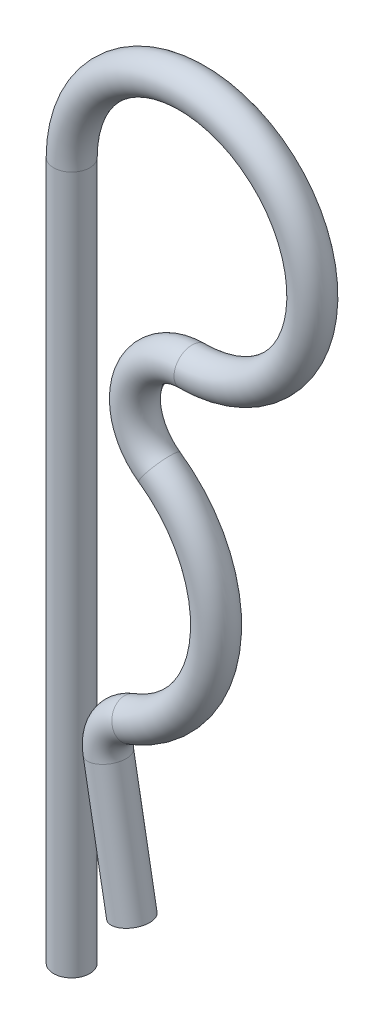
from build123d import *

# Parameters (mm, degrees)
ESQUISSE2_R = 1.5


with BuildPart() as part:
    # Base-Balayage: sweep along a path in Esquisse1
    with BuildLine(Plane.XY) as base_balayage_path:
        Line((0, 0), (0, 58))
        ThreePointArc((0, 58), (10, 68), (20, 58))
        ThreePointArc((20, 58), (17.071067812, 50.928932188), (10, 48))
        ThreePointArc((10, 48), (5.470565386, 44.674520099), (7.286762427, 39.356999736))
        ThreePointArc((7.286762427, 39.356999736), (11.918804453, 28.996502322), (4.928571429, 20.056012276))
        ThreePointArc((4.928571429, 20.056012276), (3.387023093, 18.727752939), (3.047631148, 16.721398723))
        Line((3.047631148, 16.721398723), (5, 5.896046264))
    # Esquisse2 → Base-Balayage (sweep)
    with BuildSketch(Plane(origin=(0, 0, 0), x_dir=(1, 0, 0), z_dir=(0, 1, 0))):
        Circle(ESQUISSE2_R)
    sweep(path=base_balayage_path.line)


solid = part.part
